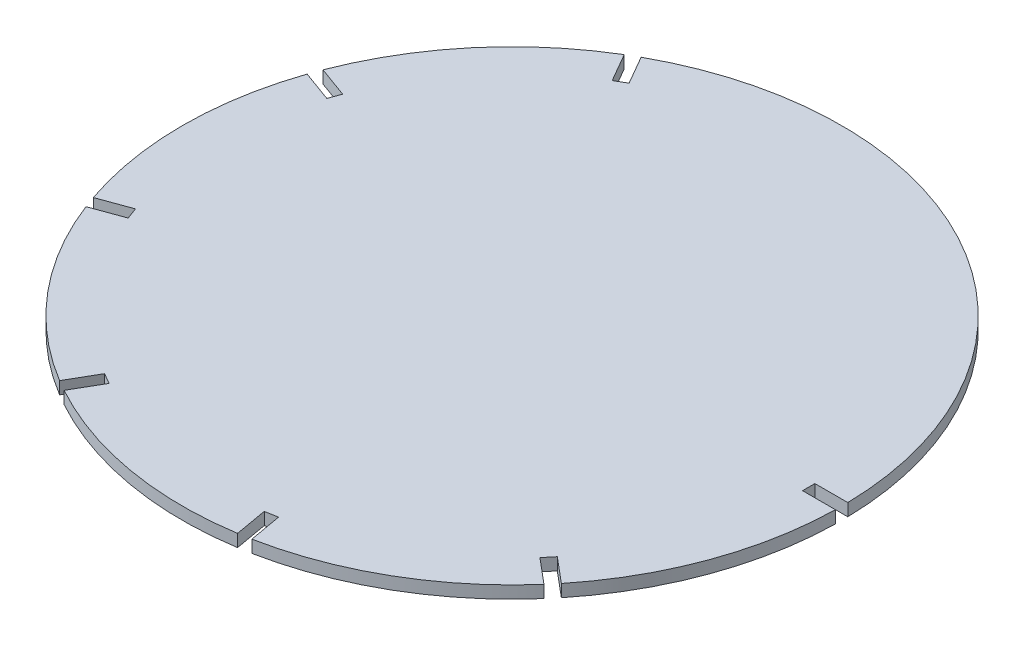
ISO-10303-21;
HEADER;
FILE_DESCRIPTION(('STEP AP214'),'2;1');
FILE_NAME('part.step','',(''),(''),'','','');
FILE_SCHEMA(('AUTOMOTIVE_DESIGN { 1 0 10303 214 1 1 1 1 }'));
ENDSEC;
DATA;
#1=APPLICATION_CONTEXT('core data for automotive mechanical design processes');
#2=APPLICATION_PROTOCOL_DEFINITION('international standard','automotive_design',2000,#1);
#3=PRODUCT_CONTEXT('',#1,'mechanical');
#4=PRODUCT('Part','Part','',(#3));
#5=PRODUCT_RELATED_PRODUCT_CATEGORY('part','',(#4));
#6=PRODUCT_DEFINITION_FORMATION('','',#4);
#7=PRODUCT_DEFINITION_CONTEXT('part definition',#1,'design');
#8=PRODUCT_DEFINITION('design','',#6,#7);
#9=PRODUCT_DEFINITION_SHAPE('','',#8);
#10=(LENGTH_UNIT() NAMED_UNIT(*) SI_UNIT(.MILLI.,.METRE.));
#11=(NAMED_UNIT(*) PLANE_ANGLE_UNIT() SI_UNIT($,.RADIAN.));
#12=(NAMED_UNIT(*) SI_UNIT($,.STERADIAN.) SOLID_ANGLE_UNIT());
#13=UNCERTAINTY_MEASURE_WITH_UNIT(LENGTH_MEASURE(1.E-05),#10,'distance_accuracy_value','');
#14=(GEOMETRIC_REPRESENTATION_CONTEXT(3) GLOBAL_UNCERTAINTY_ASSIGNED_CONTEXT((#13)) GLOBAL_UNIT_ASSIGNED_CONTEXT((#10,
#11,#12)) REPRESENTATION_CONTEXT('',''));
#15=CARTESIAN_POINT('',(0.,0.,0.));
#16=DIRECTION('',(0.,0.,1.));
#17=DIRECTION('',(1.,0.,0.));
#18=AXIS2_PLACEMENT_3D('',#15,#16,#17);
#19=CARTESIAN_POINT('',(0.,15.,0.));
#20=DIRECTION('',(0.,-1.,0.));
#21=DIRECTION('',(0.,0.,-1.));
#22=AXIS2_PLACEMENT_3D('',#19,#20,#21);
#23=CYLINDRICAL_SURFACE('',#22,400.);
#24=DIRECTION('',(0.,-1.,0.));
#25=VECTOR('',#24,1.);
#26=CARTESIAN_POINT('',(-193.46965013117,15.,350.099263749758));
#27=LINE('',#26,#25);
#28=CARTESIAN_POINT('',(-193.46965013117,0.,350.099263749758));
#29=VERTEX_POINT('',#28);
#30=CARTESIAN_POINT('',(-193.46965013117,15.,350.099263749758));
#31=VERTEX_POINT('',#30);
#32=EDGE_CURVE('E239',#29,#31,#27,.F.);
#33=ORIENTED_EDGE('',*,*,#32,.F.);
#34=CARTESIAN_POINT('',(0.,0.,0.));
#35=DIRECTION('',(0.,1.,0.));
#36=DIRECTION('',(0.,0.,1.));
#37=AXIS2_PLACEMENT_3D('',#34,#35,#36);
#38=CIRCLE('',#37,400.);
#39=CARTESIAN_POINT('',(62.0610022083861,0.,395.156212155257));
#40=VERTEX_POINT('',#39);
#41=EDGE_CURVE('E414',#29,#40,#38,.T.);
#42=ORIENTED_EDGE('',*,*,#41,.T.);
#43=DIRECTION('',(0.,-1.,0.));
#44=VECTOR('',#43,1.);
#45=CARTESIAN_POINT('',(62.0610022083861,15.,395.156212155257));
#46=LINE('',#45,#44);
#47=CARTESIAN_POINT('',(62.0610022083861,15.,395.156212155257));
#48=VERTEX_POINT('',#47);
#49=EDGE_CURVE('E368',#40,#48,#46,.F.);
#50=ORIENTED_EDGE('',*,*,#49,.T.);
#51=CARTESIAN_POINT('',(0.,15.,0.));
#52=DIRECTION('',(0.,1.,0.));
#53=DIRECTION('',(0.,0.,1.));
#54=AXIS2_PLACEMENT_3D('',#51,#52,#53);
#55=CIRCLE('',#54,400.);
#56=EDGE_CURVE('E42',#31,#48,#55,.T.);
#57=ORIENTED_EDGE('',*,*,#56,.F.);
#58=EDGE_LOOP('',(#33,#42,#50,#57));
#59=FACE_BOUND('',#58,.T.);
#60=ADVANCED_FACE('F33',(#59),#23,.T.);
#61=DIRECTION('',(0.,-1.,0.));
#62=VECTOR('',#61,1.);
#63=CARTESIAN_POINT('',(76.8331185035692,15.,392.551489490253));
#64=LINE('',#63,#62);
#65=CARTESIAN_POINT('',(76.8331185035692,0.,392.551489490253));
#66=VERTEX_POINT('',#65);
#67=CARTESIAN_POINT('',(76.8331185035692,15.,392.551489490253));
#68=VERTEX_POINT('',#67);
#69=EDGE_CURVE('E371',#66,#68,#64,.F.);
#70=ORIENTED_EDGE('',*,*,#69,.F.);
#71=CARTESIAN_POINT('',(301.543002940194,0.,262.815177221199));
#72=VERTEX_POINT('',#71);
#73=EDGE_CURVE('E419',#66,#72,#38,.T.);
#74=ORIENTED_EDGE('',*,*,#73,.T.);
#75=DIRECTION('',(0.,-1.,0.));
#76=VECTOR('',#75,1.);
#77=CARTESIAN_POINT('',(301.543002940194,15.,262.815177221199));
#78=LINE('',#77,#76);
#79=CARTESIAN_POINT('',(301.543002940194,15.,262.815177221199));
#80=VERTEX_POINT('',#79);
#81=EDGE_CURVE('E363',#72,#80,#78,.F.);
#82=ORIENTED_EDGE('',*,*,#81,.T.);
#83=EDGE_CURVE('E454',#68,#80,#55,.T.);
#84=ORIENTED_EDGE('',*,*,#83,.F.);
#85=EDGE_LOOP('',(#70,#74,#82,#84));
#86=FACE_BOUND('',#85,.T.);
#87=ADVANCED_FACE('F492',(#86),#23,.T.);
#88=DIRECTION('',(0.,-1.,0.));
#89=VECTOR('',#88,1.);
#90=CARTESIAN_POINT('',(311.184817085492,15.,251.324510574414));
#91=LINE('',#90,#89);
#92=CARTESIAN_POINT('',(311.184817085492,0.,251.324510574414));
#93=VERTEX_POINT('',#92);
#94=CARTESIAN_POINT('',(311.184817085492,15.,251.324510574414));
#95=VERTEX_POINT('',#94);
#96=EDGE_CURVE('E366',#93,#95,#91,.F.);
#97=ORIENTED_EDGE('',*,*,#96,.F.);
#98=CARTESIAN_POINT('',(399.929681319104,0.,7.5));
#99=VERTEX_POINT('',#98);
#100=EDGE_CURVE('E423',#93,#99,#38,.T.);
#101=ORIENTED_EDGE('',*,*,#100,.T.);
#102=DIRECTION('',(0.,-1.,0.));
#103=VECTOR('',#102,1.);
#104=CARTESIAN_POINT('',(399.929681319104,15.,7.5));
#105=LINE('',#104,#103);
#106=CARTESIAN_POINT('',(399.929681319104,15.,7.5));
#107=VERTEX_POINT('',#106);
#108=EDGE_CURVE('E358',#99,#107,#105,.F.);
#109=ORIENTED_EDGE('',*,*,#108,.T.);
#110=EDGE_CURVE('E452',#95,#107,#55,.T.);
#111=ORIENTED_EDGE('',*,*,#110,.F.);
#112=EDGE_LOOP('',(#97,#101,#109,#111));
#113=FACE_BOUND('',#112,.T.);
#114=ADVANCED_FACE('F505',(#113),#23,.T.);
#115=DIRECTION('',(0.,-1.,0.));
#116=VECTOR('',#115,1.);
#117=CARTESIAN_POINT('',(399.929681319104,15.,-7.5));
#118=LINE('',#117,#116);
#119=CARTESIAN_POINT('',(399.929681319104,0.,-7.5));
#120=VERTEX_POINT('',#119);
#121=CARTESIAN_POINT('',(399.929681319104,15.,-7.5));
#122=VERTEX_POINT('',#121);
#123=EDGE_CURVE('E361',#120,#122,#118,.F.);
#124=ORIENTED_EDGE('',*,*,#123,.F.);
#125=CARTESIAN_POINT('',(-193.469650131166,0.,-350.09926374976));
#126=VERTEX_POINT('',#125);
#127=EDGE_CURVE('E412',#120,#126,#38,.T.);
#128=ORIENTED_EDGE('',*,*,#127,.T.);
#129=DIRECTION('',(0.,-1.,0.));
#130=VECTOR('',#129,1.);
#131=CARTESIAN_POINT('',(-193.469650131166,15.,-350.09926374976));
#132=LINE('',#131,#130);
#133=CARTESIAN_POINT('',(-193.469650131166,15.,-350.09926374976));
#134=VERTEX_POINT('',#133);
#135=EDGE_CURVE('E58',#126,#134,#132,.F.);
#136=ORIENTED_EDGE('',*,*,#135,.T.);
#137=EDGE_CURVE('E449',#122,#134,#55,.T.);
#138=ORIENTED_EDGE('',*,*,#137,.F.);
#139=EDGE_LOOP('',(#124,#128,#136,#138));
#140=FACE_BOUND('',#139,.T.);
#141=ADVANCED_FACE('F435',(#140),#23,.T.);
#142=DIRECTION('',(0.,-1.,0.));
#143=VECTOR('',#142,1.);
#144=CARTESIAN_POINT('',(-378.376121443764,15.,-129.736312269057));
#145=LINE('',#144,#143);
#146=CARTESIAN_POINT('',(-378.376121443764,0.,-129.736312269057));
#147=VERTEX_POINT('',#146);
#148=CARTESIAN_POINT('',(-378.376121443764,15.,-129.736312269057));
#149=VERTEX_POINT('',#148);
#150=EDGE_CURVE('E356',#147,#149,#145,.F.);
#151=ORIENTED_EDGE('',*,*,#150,.F.);
#152=CARTESIAN_POINT('',(-378.376121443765,0.,129.736312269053));
#153=VERTEX_POINT('',#152);
#154=EDGE_CURVE('E402',#147,#153,#38,.T.);
#155=ORIENTED_EDGE('',*,*,#154,.T.);
#156=DIRECTION('',(0.,-1.,0.));
#157=VECTOR('',#156,1.);
#158=CARTESIAN_POINT('',(-378.376121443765,15.,129.736312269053));
#159=LINE('',#158,#157);
#160=CARTESIAN_POINT('',(-378.376121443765,15.,129.736312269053));
#161=VERTEX_POINT('',#160);
#162=EDGE_CURVE('E397',#153,#161,#159,.F.);
#163=ORIENTED_EDGE('',*,*,#162,.T.);
#164=EDGE_CURVE('E43',#149,#161,#55,.T.);
#165=ORIENTED_EDGE('',*,*,#164,.F.);
#166=EDGE_LOOP('',(#151,#155,#163,#165));
#167=FACE_BOUND('',#166,.T.);
#168=ADVANCED_FACE('F472',(#167),#23,.T.);
#169=CARTESIAN_POINT('',(-206.460031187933,0.,-342.59926374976));
#170=VERTEX_POINT('',#169);
#171=CARTESIAN_POINT('',(-373.245819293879,0.,-143.831701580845));
#172=VERTEX_POINT('',#171);
#173=EDGE_CURVE('E406',#170,#172,#38,.T.);
#174=ORIENTED_EDGE('',*,*,#173,.T.);
#175=DIRECTION('',(0.,-1.,0.));
#176=VECTOR('',#175,1.);
#177=CARTESIAN_POINT('',(-373.245819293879,15.,-143.831701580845));
#178=LINE('',#177,#176);
#179=CARTESIAN_POINT('',(-373.245819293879,15.,-143.831701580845));
#180=VERTEX_POINT('',#179);
#181=EDGE_CURVE('E50',#172,#180,#178,.F.);
#182=ORIENTED_EDGE('',*,*,#181,.T.);
#183=CARTESIAN_POINT('',(-206.460031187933,15.,-342.59926374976));
#184=VERTEX_POINT('',#183);
#185=EDGE_CURVE('E417',#184,#180,#55,.T.);
#186=ORIENTED_EDGE('',*,*,#185,.F.);
#187=DIRECTION('',(0.,-1.,0.));
#188=VECTOR('',#187,1.);
#189=CARTESIAN_POINT('',(-206.460031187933,15.,-342.59926374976));
#190=LINE('',#189,#188);
#191=EDGE_CURVE('E247',#170,#184,#190,.F.);
#192=ORIENTED_EDGE('',*,*,#191,.F.);
#193=EDGE_LOOP('',(#174,#182,#186,#192));
#194=FACE_BOUND('',#193,.T.);
#195=ADVANCED_FACE('F461',(#194),#23,.T.);
#196=CARTESIAN_POINT('',(0.,15.,0.));
#197=DIRECTION('',(0.,1.,0.));
#198=DIRECTION('',(0.,0.,1.));
#199=AXIS2_PLACEMENT_3D('',#196,#197,#198);
#200=PLANE('',#199);
#201=DIRECTION('',(-0.866025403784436,0.,-0.500000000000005));
#202=VECTOR('',#201,1.);
#203=CARTESIAN_POINT('',(-173.504809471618,15.,315.519145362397));
#204=LINE('',#203,#202);
#205=CARTESIAN_POINT('',(-173.504809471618,15.,315.519145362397));
#206=VERTEX_POINT('',#205);
#207=CARTESIAN_POINT('',(-186.495190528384,15.,308.019145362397));
#208=VERTEX_POINT('',#207);
#209=EDGE_CURVE('E226',#206,#208,#204,.T.);
#210=ORIENTED_EDGE('',*,*,#209,.F.);
#211=DIRECTION('',(-0.500000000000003,0.,0.866025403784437));
#212=VECTOR('',#211,1.);
#213=CARTESIAN_POINT('',(-173.504809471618,15.,315.519145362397));
#214=LINE('',#213,#212);
#215=EDGE_CURVE('E236',#206,#31,#214,.T.);
#216=ORIENTED_EDGE('',*,*,#215,.T.);
#217=ORIENTED_EDGE('',*,*,#56,.T.);
#218=DIRECTION('',(0.173648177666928,0.,0.984807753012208));
#219=VECTOR('',#218,1.);
#220=CARTESIAN_POINT('',(55.1272858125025,15.,355.833152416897));
#221=LINE('',#220,#219);
#222=CARTESIAN_POINT('',(55.1272858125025,15.,355.833152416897));
#223=VERTEX_POINT('',#222);
#224=EDGE_CURVE('E266',#223,#48,#221,.T.);
#225=ORIENTED_EDGE('',*,*,#224,.F.);
#226=DIRECTION('',(-0.984807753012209,0.,0.173648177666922));
#227=VECTOR('',#226,1.);
#228=CARTESIAN_POINT('',(69.8994021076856,15.,353.228429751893));
#229=LINE('',#228,#227);
#230=CARTESIAN_POINT('',(69.8994021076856,15.,353.228429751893));
#231=VERTEX_POINT('',#230);
#232=EDGE_CURVE('E233',#231,#223,#229,.T.);
#233=ORIENTED_EDGE('',*,*,#232,.F.);
#234=DIRECTION('',(0.173648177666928,0.,0.984807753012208));
#235=VECTOR('',#234,1.);
#236=CARTESIAN_POINT('',(69.8994021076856,15.,353.228429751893));
#237=LINE('',#236,#235);
#238=EDGE_CURVE('E263',#231,#68,#237,.T.);
#239=ORIENTED_EDGE('',*,*,#238,.T.);
#240=ORIENTED_EDGE('',*,*,#83,.T.);
#241=DIRECTION('',(0.766044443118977,0.,0.64278760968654));
#242=VECTOR('',#241,1.);
#243=CARTESIAN_POINT('',(270.955092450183,15.,237.148872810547));
#244=LINE('',#243,#242);
#245=CARTESIAN_POINT('',(270.955092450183,15.,237.148872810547));
#246=VERTEX_POINT('',#245);
#247=EDGE_CURVE('E286',#246,#80,#244,.T.);
#248=ORIENTED_EDGE('',*,*,#247,.F.);
#249=DIRECTION('',(-0.642787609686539,0.,0.766044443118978));
#250=VECTOR('',#249,1.);
#251=CARTESIAN_POINT('',(280.596906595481,15.,225.658206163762));
#252=LINE('',#251,#250);
#253=CARTESIAN_POINT('',(280.596906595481,15.,225.658206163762));
#254=VERTEX_POINT('',#253);
#255=EDGE_CURVE('E262',#254,#246,#252,.T.);
#256=ORIENTED_EDGE('',*,*,#255,.F.);
#257=DIRECTION('',(0.766044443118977,0.,0.64278760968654));
#258=VECTOR('',#257,1.);
#259=CARTESIAN_POINT('',(280.596906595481,15.,225.658206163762));
#260=LINE('',#259,#258);
#261=EDGE_CURVE('E283',#254,#95,#260,.T.);
#262=ORIENTED_EDGE('',*,*,#261,.T.);
#263=ORIENTED_EDGE('',*,*,#110,.T.);
#264=DIRECTION('',(1.,0.,0.));
#265=VECTOR('',#264,1.);
#266=CARTESIAN_POINT('',(360.,15.,7.5));
#267=LINE('',#266,#265);
#268=CARTESIAN_POINT('',(360.,15.,7.5));
#269=VERTEX_POINT('',#268);
#270=EDGE_CURVE('E306',#269,#107,#267,.T.);
#271=ORIENTED_EDGE('',*,*,#270,.F.);
#272=DIRECTION('',(0.,0.,1.));
#273=VECTOR('',#272,1.);
#274=CARTESIAN_POINT('',(360.,15.,-7.5));
#275=LINE('',#274,#273);
#276=CARTESIAN_POINT('',(360.,15.,-7.5));
#277=VERTEX_POINT('',#276);
#278=EDGE_CURVE('E282',#277,#269,#275,.T.);
#279=ORIENTED_EDGE('',*,*,#278,.F.);
#280=DIRECTION('',(1.,0.,0.));
#281=VECTOR('',#280,1.);
#282=CARTESIAN_POINT('',(360.,15.,-7.5));
#283=LINE('',#282,#281);
#284=EDGE_CURVE('E303',#277,#122,#283,.T.);
#285=ORIENTED_EDGE('',*,*,#284,.T.);
#286=ORIENTED_EDGE('',*,*,#137,.T.);
#287=DIRECTION('',(-0.499999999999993,0.,-0.866025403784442));
#288=VECTOR('',#287,1.);
#289=CARTESIAN_POINT('',(-173.504809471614,15.,-315.519145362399));
#290=LINE('',#289,#288);
#291=CARTESIAN_POINT('',(-173.504809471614,15.,-315.519145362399));
#292=VERTEX_POINT('',#291);
#293=EDGE_CURVE('E344',#292,#134,#290,.T.);
#294=ORIENTED_EDGE('',*,*,#293,.F.);
#295=DIRECTION('',(0.866025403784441,0.,-0.499999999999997));
#296=VECTOR('',#295,1.);
#297=CARTESIAN_POINT('',(-186.495190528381,15.,-308.019145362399));
#298=LINE('',#297,#296);
#299=CARTESIAN_POINT('',(-186.495190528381,15.,-308.019145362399));
#300=VERTEX_POINT('',#299);
#301=EDGE_CURVE('E322',#300,#292,#298,.T.);
#302=ORIENTED_EDGE('',*,*,#301,.F.);
#303=DIRECTION('',(-0.499999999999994,0.,-0.866025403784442));
#304=VECTOR('',#303,1.);
#305=CARTESIAN_POINT('',(-186.495190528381,15.,-308.019145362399));
#306=LINE('',#305,#304);
#307=EDGE_CURVE('E341',#300,#184,#306,.T.);
#308=ORIENTED_EDGE('',*,*,#307,.T.);
#309=ORIENTED_EDGE('',*,*,#185,.T.);
#310=DIRECTION('',(-0.939692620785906,0.,-0.342020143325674));
#311=VECTOR('',#310,1.);
#312=CARTESIAN_POINT('',(-335.724192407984,15.,-130.174946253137));
#313=LINE('',#312,#311);
#314=CARTESIAN_POINT('',(-335.724192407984,15.,-130.174946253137));
#315=VERTEX_POINT('',#314);
#316=EDGE_CURVE('E326',#315,#180,#313,.T.);
#317=ORIENTED_EDGE('',*,*,#316,.F.);
#318=DIRECTION('',(0.342020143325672,0.,-0.939692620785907));
#319=VECTOR('',#318,1.);
#320=CARTESIAN_POINT('',(-340.854494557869,15.,-116.079556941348));
#321=LINE('',#320,#319);
#322=CARTESIAN_POINT('',(-340.854494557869,15.,-116.079556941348));
#323=VERTEX_POINT('',#322);
#324=EDGE_CURVE('E302',#323,#315,#321,.T.);
#325=ORIENTED_EDGE('',*,*,#324,.F.);
#326=DIRECTION('',(-0.939692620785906,0.,-0.342020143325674));
#327=VECTOR('',#326,1.);
#328=CARTESIAN_POINT('',(-340.854494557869,15.,-116.079556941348));
#329=LINE('',#328,#327);
#330=EDGE_CURVE('E323',#323,#149,#329,.T.);
#331=ORIENTED_EDGE('',*,*,#330,.T.);
#332=ORIENTED_EDGE('',*,*,#164,.T.);
#333=DIRECTION('',(-0.93969262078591,0.,0.342020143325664));
#334=VECTOR('',#333,1.);
#335=CARTESIAN_POINT('',(-340.85449455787,15.,116.079556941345));
#336=LINE('',#335,#334);
#337=CARTESIAN_POINT('',(-340.85449455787,15.,116.079556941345));
#338=VERTEX_POINT('',#337);
#339=EDGE_CURVE('E390',#338,#161,#336,.T.);
#340=ORIENTED_EDGE('',*,*,#339,.F.);
#341=DIRECTION('',(-0.342020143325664,0.,-0.93969262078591));
#342=VECTOR('',#341,1.);
#343=CARTESIAN_POINT('',(-335.724192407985,15.,130.174946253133));
#344=LINE('',#343,#342);
#345=CARTESIAN_POINT('',(-335.724192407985,15.,130.174946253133));
#346=VERTEX_POINT('',#345);
#347=EDGE_CURVE('E377',#346,#338,#344,.T.);
#348=ORIENTED_EDGE('',*,*,#347,.F.);
#349=DIRECTION('',(-0.93969262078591,0.,0.342020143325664));
#350=VECTOR('',#349,1.);
#351=CARTESIAN_POINT('',(-335.724192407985,15.,130.174946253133));
#352=LINE('',#351,#350);
#353=CARTESIAN_POINT('',(-373.24581929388,15.,143.831701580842));
#354=VERTEX_POINT('',#353);
#355=EDGE_CURVE('E382',#346,#354,#352,.T.);
#356=ORIENTED_EDGE('',*,*,#355,.T.);
#357=CARTESIAN_POINT('',(-206.460031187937,15.,342.599263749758));
#358=VERTEX_POINT('',#357);
#359=EDGE_CURVE('E11',#354,#358,#55,.T.);
#360=ORIENTED_EDGE('',*,*,#359,.T.);
#361=DIRECTION('',(-0.500000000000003,0.,0.866025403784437));
#362=VECTOR('',#361,1.);
#363=CARTESIAN_POINT('',(-186.495190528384,15.,308.019145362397));
#364=LINE('',#363,#362);
#365=EDGE_CURVE('E243',#208,#358,#364,.T.);
#366=ORIENTED_EDGE('',*,*,#365,.F.);
#367=EDGE_LOOP('',(#210,#216,#217,#225,#233,#239,#240,#248,#256,#262,#263,#271,#279,#285,#286,
#294,#302,#308,#309,#317,#325,#331,#332,#340,#348,#356,#360,#366));
#368=FACE_BOUND('',#367,.T.);
#369=ADVANCED_FACE('F245',(#368),#200,.T.);
#370=CARTESIAN_POINT('',(0.,0.,0.));
#371=DIRECTION('',(0.,1.,0.));
#372=DIRECTION('',(0.,0.,1.));
#373=AXIS2_PLACEMENT_3D('',#370,#371,#372);
#374=PLANE('',#373);
#375=DIRECTION('',(-0.500000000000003,0.,0.866025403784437));
#376=VECTOR('',#375,1.);
#377=CARTESIAN_POINT('',(-173.504809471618,0.,315.519145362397));
#378=LINE('',#377,#376);
#379=CARTESIAN_POINT('',(-173.504809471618,0.,315.519145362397));
#380=VERTEX_POINT('',#379);
#381=EDGE_CURVE('E251',#380,#29,#378,.T.);
#382=ORIENTED_EDGE('',*,*,#381,.F.);
#383=DIRECTION('',(-0.866025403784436,0.,-0.500000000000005));
#384=VECTOR('',#383,1.);
#385=CARTESIAN_POINT('',(-173.504809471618,0.,315.519145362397));
#386=LINE('',#385,#384);
#387=CARTESIAN_POINT('',(-186.495190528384,0.,308.019145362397));
#388=VERTEX_POINT('',#387);
#389=EDGE_CURVE('E229',#380,#388,#386,.T.);
#390=ORIENTED_EDGE('',*,*,#389,.T.);
#391=DIRECTION('',(-0.500000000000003,0.,0.866025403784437));
#392=VECTOR('',#391,1.);
#393=CARTESIAN_POINT('',(-186.495190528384,0.,308.019145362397));
#394=LINE('',#393,#392);
#395=CARTESIAN_POINT('',(-206.460031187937,0.,342.599263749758));
#396=VERTEX_POINT('',#395);
#397=EDGE_CURVE('E253',#388,#396,#394,.T.);
#398=ORIENTED_EDGE('',*,*,#397,.T.);
#399=CARTESIAN_POINT('',(-373.24581929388,0.,143.831701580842));
#400=VERTEX_POINT('',#399);
#401=EDGE_CURVE('E37',#400,#396,#38,.T.);
#402=ORIENTED_EDGE('',*,*,#401,.F.);
#403=DIRECTION('',(-0.93969262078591,0.,0.342020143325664));
#404=VECTOR('',#403,1.);
#405=CARTESIAN_POINT('',(-335.724192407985,0.,130.174946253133));
#406=LINE('',#405,#404);
#407=CARTESIAN_POINT('',(-335.724192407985,0.,130.174946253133));
#408=VERTEX_POINT('',#407);
#409=EDGE_CURVE('E385',#408,#400,#406,.T.);
#410=ORIENTED_EDGE('',*,*,#409,.F.);
#411=DIRECTION('',(-0.342020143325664,0.,-0.93969262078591));
#412=VECTOR('',#411,1.);
#413=CARTESIAN_POINT('',(-335.724192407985,0.,130.174946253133));
#414=LINE('',#413,#412);
#415=CARTESIAN_POINT('',(-340.85449455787,0.,116.079556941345));
#416=VERTEX_POINT('',#415);
#417=EDGE_CURVE('E378',#408,#416,#414,.T.);
#418=ORIENTED_EDGE('',*,*,#417,.T.);
#419=DIRECTION('',(-0.93969262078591,0.,0.342020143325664));
#420=VECTOR('',#419,1.);
#421=CARTESIAN_POINT('',(-340.85449455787,0.,116.079556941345));
#422=LINE('',#421,#420);
#423=EDGE_CURVE('E381',#416,#153,#422,.T.);
#424=ORIENTED_EDGE('',*,*,#423,.T.);
#425=ORIENTED_EDGE('',*,*,#154,.F.);
#426=DIRECTION('',(-0.939692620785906,0.,-0.342020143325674));
#427=VECTOR('',#426,1.);
#428=CARTESIAN_POINT('',(-340.854494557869,0.,-116.079556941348));
#429=LINE('',#428,#427);
#430=CARTESIAN_POINT('',(-340.854494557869,0.,-116.079556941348));
#431=VERTEX_POINT('',#430);
#432=EDGE_CURVE('E319',#431,#147,#429,.T.);
#433=ORIENTED_EDGE('',*,*,#432,.F.);
#434=DIRECTION('',(0.342020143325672,0.,-0.939692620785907));
#435=VECTOR('',#434,1.);
#436=CARTESIAN_POINT('',(-340.854494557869,0.,-116.079556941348));
#437=LINE('',#436,#435);
#438=CARTESIAN_POINT('',(-335.724192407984,0.,-130.174946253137));
#439=VERTEX_POINT('',#438);
#440=EDGE_CURVE('E327',#431,#439,#437,.T.);
#441=ORIENTED_EDGE('',*,*,#440,.T.);
#442=DIRECTION('',(-0.939692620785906,0.,-0.342020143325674));
#443=VECTOR('',#442,1.);
#444=CARTESIAN_POINT('',(-335.724192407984,0.,-130.174946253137));
#445=LINE('',#444,#443);
#446=EDGE_CURVE('E332',#439,#172,#445,.T.);
#447=ORIENTED_EDGE('',*,*,#446,.T.);
#448=ORIENTED_EDGE('',*,*,#173,.F.);
#449=DIRECTION('',(-0.499999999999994,0.,-0.866025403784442));
#450=VECTOR('',#449,1.);
#451=CARTESIAN_POINT('',(-186.495190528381,0.,-308.019145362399));
#452=LINE('',#451,#450);
#453=CARTESIAN_POINT('',(-186.495190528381,0.,-308.019145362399));
#454=VERTEX_POINT('',#453);
#455=EDGE_CURVE('E338',#454,#170,#452,.T.);
#456=ORIENTED_EDGE('',*,*,#455,.F.);
#457=DIRECTION('',(0.866025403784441,0.,-0.499999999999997));
#458=VECTOR('',#457,1.);
#459=CARTESIAN_POINT('',(-186.495190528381,0.,-308.019145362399));
#460=LINE('',#459,#458);
#461=CARTESIAN_POINT('',(-173.504809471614,0.,-315.519145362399));
#462=VERTEX_POINT('',#461);
#463=EDGE_CURVE('E345',#454,#462,#460,.T.);
#464=ORIENTED_EDGE('',*,*,#463,.T.);
#465=DIRECTION('',(-0.499999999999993,0.,-0.866025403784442));
#466=VECTOR('',#465,1.);
#467=CARTESIAN_POINT('',(-173.504809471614,0.,-315.519145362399));
#468=LINE('',#467,#466);
#469=EDGE_CURVE('E350',#462,#126,#468,.T.);
#470=ORIENTED_EDGE('',*,*,#469,.T.);
#471=ORIENTED_EDGE('',*,*,#127,.F.);
#472=DIRECTION('',(1.,0.,0.));
#473=VECTOR('',#472,1.);
#474=CARTESIAN_POINT('',(360.,0.,-7.5));
#475=LINE('',#474,#473);
#476=CARTESIAN_POINT('',(360.,0.,-7.5));
#477=VERTEX_POINT('',#476);
#478=EDGE_CURVE('E299',#477,#120,#475,.T.);
#479=ORIENTED_EDGE('',*,*,#478,.F.);
#480=DIRECTION('',(0.,0.,1.));
#481=VECTOR('',#480,1.);
#482=CARTESIAN_POINT('',(360.,0.,-7.5));
#483=LINE('',#482,#481);
#484=CARTESIAN_POINT('',(360.,0.,7.5));
#485=VERTEX_POINT('',#484);
#486=EDGE_CURVE('E307',#477,#485,#483,.T.);
#487=ORIENTED_EDGE('',*,*,#486,.T.);
#488=DIRECTION('',(1.,0.,0.));
#489=VECTOR('',#488,1.);
#490=CARTESIAN_POINT('',(360.,0.,7.5));
#491=LINE('',#490,#489);
#492=EDGE_CURVE('E312',#485,#99,#491,.T.);
#493=ORIENTED_EDGE('',*,*,#492,.T.);
#494=ORIENTED_EDGE('',*,*,#100,.F.);
#495=DIRECTION('',(0.766044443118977,0.,0.64278760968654));
#496=VECTOR('',#495,1.);
#497=CARTESIAN_POINT('',(280.596906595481,0.,225.658206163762));
#498=LINE('',#497,#496);
#499=CARTESIAN_POINT('',(280.596906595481,0.,225.658206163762));
#500=VERTEX_POINT('',#499);
#501=EDGE_CURVE('E279',#500,#93,#498,.T.);
#502=ORIENTED_EDGE('',*,*,#501,.F.);
#503=DIRECTION('',(-0.642787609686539,0.,0.766044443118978));
#504=VECTOR('',#503,1.);
#505=CARTESIAN_POINT('',(280.596906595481,0.,225.658206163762));
#506=LINE('',#505,#504);
#507=CARTESIAN_POINT('',(270.955092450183,0.,237.148872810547));
#508=VERTEX_POINT('',#507);
#509=EDGE_CURVE('E287',#500,#508,#506,.T.);
#510=ORIENTED_EDGE('',*,*,#509,.T.);
#511=DIRECTION('',(0.766044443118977,0.,0.64278760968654));
#512=VECTOR('',#511,1.);
#513=CARTESIAN_POINT('',(270.955092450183,0.,237.148872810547));
#514=LINE('',#513,#512);
#515=EDGE_CURVE('E292',#508,#72,#514,.T.);
#516=ORIENTED_EDGE('',*,*,#515,.T.);
#517=ORIENTED_EDGE('',*,*,#73,.F.);
#518=DIRECTION('',(0.173648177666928,0.,0.984807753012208));
#519=VECTOR('',#518,1.);
#520=CARTESIAN_POINT('',(69.8994021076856,0.,353.228429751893));
#521=LINE('',#520,#519);
#522=CARTESIAN_POINT('',(69.8994021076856,0.,353.228429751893));
#523=VERTEX_POINT('',#522);
#524=EDGE_CURVE('E259',#523,#66,#521,.T.);
#525=ORIENTED_EDGE('',*,*,#524,.F.);
#526=DIRECTION('',(-0.984807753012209,0.,0.173648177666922));
#527=VECTOR('',#526,1.);
#528=CARTESIAN_POINT('',(69.8994021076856,0.,353.228429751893));
#529=LINE('',#528,#527);
#530=CARTESIAN_POINT('',(55.1272858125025,0.,355.833152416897));
#531=VERTEX_POINT('',#530);
#532=EDGE_CURVE('E267',#523,#531,#529,.T.);
#533=ORIENTED_EDGE('',*,*,#532,.T.);
#534=DIRECTION('',(0.173648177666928,0.,0.984807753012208));
#535=VECTOR('',#534,1.);
#536=CARTESIAN_POINT('',(55.1272858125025,0.,355.833152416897));
#537=LINE('',#536,#535);
#538=EDGE_CURVE('E272',#531,#40,#537,.T.);
#539=ORIENTED_EDGE('',*,*,#538,.T.);
#540=ORIENTED_EDGE('',*,*,#41,.F.);
#541=EDGE_LOOP('',(#382,#390,#398,#402,#410,#418,#424,#425,#433,#441,#447,#448,#456,#464,#470,
#471,#479,#487,#493,#494,#502,#510,#516,#517,#525,#533,#539,#540));
#542=FACE_BOUND('',#541,.T.);
#543=ADVANCED_FACE('F440',(#542),#374,.F.);
#544=ORIENTED_EDGE('',*,*,#401,.T.);
#545=DIRECTION('',(0.,-1.,0.));
#546=VECTOR('',#545,1.);
#547=CARTESIAN_POINT('',(-206.460031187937,15.,342.599263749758));
#548=LINE('',#547,#546);
#549=EDGE_CURVE('E373',#396,#358,#548,.F.);
#550=ORIENTED_EDGE('',*,*,#549,.T.);
#551=ORIENTED_EDGE('',*,*,#359,.F.);
#552=DIRECTION('',(0.,-1.,0.));
#553=VECTOR('',#552,1.);
#554=CARTESIAN_POINT('',(-373.24581929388,15.,143.831701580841));
#555=LINE('',#554,#553);
#556=EDGE_CURVE('E401',#400,#354,#555,.F.);
#557=ORIENTED_EDGE('',*,*,#556,.F.);
#558=EDGE_LOOP('',(#544,#550,#551,#557));
#559=FACE_BOUND('',#558,.T.);
#560=ADVANCED_FACE('F35',(#559),#23,.T.);
#561=CARTESIAN_POINT('',(-335.724192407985,0.,130.174946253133));
#562=DIRECTION('',(-0.342020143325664,0.,-0.93969262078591));
#563=DIRECTION('',(-0.93969262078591,0.,0.342020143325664));
#564=AXIS2_PLACEMENT_3D('',#561,#562,#563);
#565=PLANE('',#564);
#566=ORIENTED_EDGE('',*,*,#556,.T.);
#567=ORIENTED_EDGE('',*,*,#355,.F.);
#568=DIRECTION('',(0.,1.,0.));
#569=VECTOR('',#568,1.);
#570=CARTESIAN_POINT('',(-335.724192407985,0.,130.174946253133));
#571=LINE('',#570,#569);
#572=EDGE_CURVE('E395',#408,#346,#571,.T.);
#573=ORIENTED_EDGE('',*,*,#572,.F.);
#574=ORIENTED_EDGE('',*,*,#409,.T.);
#575=EDGE_LOOP('',(#566,#567,#573,#574));
#576=FACE_BOUND('',#575,.T.);
#577=ADVANCED_FACE('F527',(#576),#565,.T.);
#578=CARTESIAN_POINT('',(-340.85449455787,0.,116.079556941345));
#579=DIRECTION('',(-0.342020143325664,0.,-0.93969262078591));
#580=DIRECTION('',(-0.93969262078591,0.,0.342020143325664));
#581=AXIS2_PLACEMENT_3D('',#578,#579,#580);
#582=PLANE('',#581);
#583=ORIENTED_EDGE('',*,*,#423,.F.);
#584=DIRECTION('',(0.,1.,0.));
#585=VECTOR('',#584,1.);
#586=CARTESIAN_POINT('',(-340.85449455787,0.,116.079556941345));
#587=LINE('',#586,#585);
#588=EDGE_CURVE('E387',#416,#338,#587,.T.);
#589=ORIENTED_EDGE('',*,*,#588,.T.);
#590=ORIENTED_EDGE('',*,*,#339,.T.);
#591=ORIENTED_EDGE('',*,*,#162,.F.);
#592=EDGE_LOOP('',(#583,#589,#590,#591));
#593=FACE_BOUND('',#592,.T.);
#594=ADVANCED_FACE('F475',(#593),#582,.F.);
#595=CARTESIAN_POINT('',(-335.724192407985,0.,130.174946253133));
#596=DIRECTION('',(0.93969262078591,0.,-0.342020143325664));
#597=DIRECTION('',(-0.342020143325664,0.,-0.93969262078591));
#598=AXIS2_PLACEMENT_3D('',#595,#596,#597);
#599=PLANE('',#598);
#600=ORIENTED_EDGE('',*,*,#347,.T.);
#601=ORIENTED_EDGE('',*,*,#588,.F.);
#602=ORIENTED_EDGE('',*,*,#417,.F.);
#603=ORIENTED_EDGE('',*,*,#572,.T.);
#604=EDGE_LOOP('',(#600,#601,#602,#603));
#605=FACE_BOUND('',#604,.T.);
#606=ADVANCED_FACE('F479',(#605),#599,.F.);
#607=CARTESIAN_POINT('',(-186.495190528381,0.,-308.019145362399));
#608=DIRECTION('',(0.866025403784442,0.,-0.499999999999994));
#609=DIRECTION('',(-0.499999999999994,0.,-0.866025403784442));
#610=AXIS2_PLACEMENT_3D('',#607,#608,#609);
#611=PLANE('',#610);
#612=ORIENTED_EDGE('',*,*,#191,.T.);
#613=ORIENTED_EDGE('',*,*,#307,.F.);
#614=DIRECTION('',(0.,1.,0.));
#615=VECTOR('',#614,1.);
#616=CARTESIAN_POINT('',(-186.495190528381,0.,-308.019145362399));
#617=LINE('',#616,#615);
#618=EDGE_CURVE('E339',#454,#300,#617,.T.);
#619=ORIENTED_EDGE('',*,*,#618,.F.);
#620=ORIENTED_EDGE('',*,*,#455,.T.);
#621=EDGE_LOOP('',(#612,#613,#619,#620));
#622=FACE_BOUND('',#621,.T.);
#623=ADVANCED_FACE('F577',(#622),#611,.T.);
#624=CARTESIAN_POINT('',(-173.504809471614,0.,-315.519145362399));
#625=DIRECTION('',(0.866025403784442,0.,-0.499999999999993));
#626=DIRECTION('',(-0.499999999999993,0.,-0.866025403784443));
#627=AXIS2_PLACEMENT_3D('',#624,#625,#626);
#628=PLANE('',#627);
#629=ORIENTED_EDGE('',*,*,#469,.F.);
#630=DIRECTION('',(0.,1.,0.));
#631=VECTOR('',#630,1.);
#632=CARTESIAN_POINT('',(-173.504809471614,0.,-315.519145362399));
#633=LINE('',#632,#631);
#634=EDGE_CURVE('E336',#462,#292,#633,.T.);
#635=ORIENTED_EDGE('',*,*,#634,.T.);
#636=ORIENTED_EDGE('',*,*,#293,.T.);
#637=ORIENTED_EDGE('',*,*,#135,.F.);
#638=EDGE_LOOP('',(#629,#635,#636,#637));
#639=FACE_BOUND('',#638,.T.);
#640=ADVANCED_FACE('F443',(#639),#628,.F.);
#641=CARTESIAN_POINT('',(-186.495190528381,0.,-308.019145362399));
#642=DIRECTION('',(0.499999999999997,0.,0.866025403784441));
#643=DIRECTION('',(0.866025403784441,0.,-0.499999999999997));
#644=AXIS2_PLACEMENT_3D('',#641,#642,#643);
#645=PLANE('',#644);
#646=ORIENTED_EDGE('',*,*,#301,.T.);
#647=ORIENTED_EDGE('',*,*,#634,.F.);
#648=ORIENTED_EDGE('',*,*,#463,.F.);
#649=ORIENTED_EDGE('',*,*,#618,.T.);
#650=EDGE_LOOP('',(#646,#647,#648,#649));
#651=FACE_BOUND('',#650,.T.);
#652=ADVANCED_FACE('F447',(#651),#645,.F.);
#653=CARTESIAN_POINT('',(-340.854494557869,0.,-116.079556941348));
#654=DIRECTION('',(0.342020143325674,0.,-0.939692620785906));
#655=DIRECTION('',(-0.939692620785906,0.,-0.342020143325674));
#656=AXIS2_PLACEMENT_3D('',#653,#654,#655);
#657=PLANE('',#656);
#658=ORIENTED_EDGE('',*,*,#150,.T.);
#659=ORIENTED_EDGE('',*,*,#330,.F.);
#660=DIRECTION('',(0.,1.,0.));
#661=VECTOR('',#660,1.);
#662=CARTESIAN_POINT('',(-340.854494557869,0.,-116.079556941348));
#663=LINE('',#662,#661);
#664=EDGE_CURVE('E320',#431,#323,#663,.T.);
#665=ORIENTED_EDGE('',*,*,#664,.F.);
#666=ORIENTED_EDGE('',*,*,#432,.T.);
#667=EDGE_LOOP('',(#658,#659,#665,#666));
#668=FACE_BOUND('',#667,.T.);
#669=ADVANCED_FACE('F600',(#668),#657,.T.);
#670=CARTESIAN_POINT('',(-335.724192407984,0.,-130.174946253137));
#671=DIRECTION('',(0.342020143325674,0.,-0.939692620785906));
#672=DIRECTION('',(-0.939692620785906,0.,-0.342020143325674));
#673=AXIS2_PLACEMENT_3D('',#670,#671,#672);
#674=PLANE('',#673);
#675=ORIENTED_EDGE('',*,*,#446,.F.);
#676=DIRECTION('',(0.,1.,0.));
#677=VECTOR('',#676,1.);
#678=CARTESIAN_POINT('',(-335.724192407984,0.,-130.174946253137));
#679=LINE('',#678,#677);
#680=EDGE_CURVE('E317',#439,#315,#679,.T.);
#681=ORIENTED_EDGE('',*,*,#680,.T.);
#682=ORIENTED_EDGE('',*,*,#316,.T.);
#683=ORIENTED_EDGE('',*,*,#181,.F.);
#684=EDGE_LOOP('',(#675,#681,#682,#683));
#685=FACE_BOUND('',#684,.T.);
#686=ADVANCED_FACE('F465',(#685),#674,.F.);
#687=CARTESIAN_POINT('',(-340.854494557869,0.,-116.079556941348));
#688=DIRECTION('',(0.939692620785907,0.,0.342020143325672));
#689=DIRECTION('',(0.342020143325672,0.,-0.939692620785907));
#690=AXIS2_PLACEMENT_3D('',#687,#688,#689);
#691=PLANE('',#690);
#692=ORIENTED_EDGE('',*,*,#324,.T.);
#693=ORIENTED_EDGE('',*,*,#680,.F.);
#694=ORIENTED_EDGE('',*,*,#440,.F.);
#695=ORIENTED_EDGE('',*,*,#664,.T.);
#696=EDGE_LOOP('',(#692,#693,#694,#695));
#697=FACE_BOUND('',#696,.T.);
#698=ADVANCED_FACE('F467',(#697),#691,.F.);
#699=CARTESIAN_POINT('',(360.,0.,-7.5));
#700=DIRECTION('',(0.,0.,1.));
#701=DIRECTION('',(1.,0.,0.));
#702=AXIS2_PLACEMENT_3D('',#699,#700,#701);
#703=PLANE('',#702);
#704=ORIENTED_EDGE('',*,*,#123,.T.);
#705=ORIENTED_EDGE('',*,*,#284,.F.);
#706=DIRECTION('',(0.,1.,0.));
#707=VECTOR('',#706,1.);
#708=CARTESIAN_POINT('',(360.,0.,-7.5));
#709=LINE('',#708,#707);
#710=EDGE_CURVE('E300',#477,#277,#709,.T.);
#711=ORIENTED_EDGE('',*,*,#710,.F.);
#712=ORIENTED_EDGE('',*,*,#478,.T.);
#713=EDGE_LOOP('',(#704,#705,#711,#712));
#714=FACE_BOUND('',#713,.T.);
#715=ADVANCED_FACE('F513',(#714),#703,.T.);
#716=CARTESIAN_POINT('',(360.,0.,7.5));
#717=DIRECTION('',(0.,0.,1.));
#718=DIRECTION('',(1.,0.,0.));
#719=AXIS2_PLACEMENT_3D('',#716,#717,#718);
#720=PLANE('',#719);
#721=ORIENTED_EDGE('',*,*,#492,.F.);
#722=DIRECTION('',(0.,1.,0.));
#723=VECTOR('',#722,1.);
#724=CARTESIAN_POINT('',(360.,0.,7.5));
#725=LINE('',#724,#723);
#726=EDGE_CURVE('E297',#485,#269,#725,.T.);
#727=ORIENTED_EDGE('',*,*,#726,.T.);
#728=ORIENTED_EDGE('',*,*,#270,.T.);
#729=ORIENTED_EDGE('',*,*,#108,.F.);
#730=EDGE_LOOP('',(#721,#727,#728,#729));
#731=FACE_BOUND('',#730,.T.);
#732=ADVANCED_FACE('F508',(#731),#720,.F.);
#733=CARTESIAN_POINT('',(360.,0.,-7.5));
#734=DIRECTION('',(-1.,0.,0.));
#735=DIRECTION('',(0.,0.,1.));
#736=AXIS2_PLACEMENT_3D('',#733,#734,#735);
#737=PLANE('',#736);
#738=ORIENTED_EDGE('',*,*,#278,.T.);
#739=ORIENTED_EDGE('',*,*,#726,.F.);
#740=ORIENTED_EDGE('',*,*,#486,.F.);
#741=ORIENTED_EDGE('',*,*,#710,.T.);
#742=EDGE_LOOP('',(#738,#739,#740,#741));
#743=FACE_BOUND('',#742,.T.);
#744=ADVANCED_FACE('F511',(#743),#737,.F.);
#745=CARTESIAN_POINT('',(280.596906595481,0.,225.658206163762));
#746=DIRECTION('',(-0.64278760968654,0.,0.766044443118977));
#747=DIRECTION('',(0.766044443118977,0.,0.64278760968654));
#748=AXIS2_PLACEMENT_3D('',#745,#746,#747);
#749=PLANE('',#748);
#750=ORIENTED_EDGE('',*,*,#96,.T.);
#751=ORIENTED_EDGE('',*,*,#261,.F.);
#752=DIRECTION('',(0.,1.,0.));
#753=VECTOR('',#752,1.);
#754=CARTESIAN_POINT('',(280.596906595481,0.,225.658206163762));
#755=LINE('',#754,#753);
#756=EDGE_CURVE('E280',#500,#254,#755,.T.);
#757=ORIENTED_EDGE('',*,*,#756,.F.);
#758=ORIENTED_EDGE('',*,*,#501,.T.);
#759=EDGE_LOOP('',(#750,#751,#757,#758));
#760=FACE_BOUND('',#759,.T.);
#761=ADVANCED_FACE('F636',(#760),#749,.T.);
#762=CARTESIAN_POINT('',(270.955092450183,0.,237.148872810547));
#763=DIRECTION('',(-0.64278760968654,0.,0.766044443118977));
#764=DIRECTION('',(0.766044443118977,0.,0.64278760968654));
#765=AXIS2_PLACEMENT_3D('',#762,#763,#764);
#766=PLANE('',#765);
#767=ORIENTED_EDGE('',*,*,#515,.F.);
#768=DIRECTION('',(0.,1.,0.));
#769=VECTOR('',#768,1.);
#770=CARTESIAN_POINT('',(270.955092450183,0.,237.148872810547));
#771=LINE('',#770,#769);
#772=EDGE_CURVE('E277',#508,#246,#771,.T.);
#773=ORIENTED_EDGE('',*,*,#772,.T.);
#774=ORIENTED_EDGE('',*,*,#247,.T.);
#775=ORIENTED_EDGE('',*,*,#81,.F.);
#776=EDGE_LOOP('',(#767,#773,#774,#775));
#777=FACE_BOUND('',#776,.T.);
#778=ADVANCED_FACE('F495',(#777),#766,.F.);
#779=CARTESIAN_POINT('',(280.596906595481,0.,225.658206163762));
#780=DIRECTION('',(-0.766044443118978,0.,-0.642787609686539));
#781=DIRECTION('',(-0.642787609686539,0.,0.766044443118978));
#782=AXIS2_PLACEMENT_3D('',#779,#780,#781);
#783=PLANE('',#782);
#784=ORIENTED_EDGE('',*,*,#255,.T.);
#785=ORIENTED_EDGE('',*,*,#772,.F.);
#786=ORIENTED_EDGE('',*,*,#509,.F.);
#787=ORIENTED_EDGE('',*,*,#756,.T.);
#788=EDGE_LOOP('',(#784,#785,#786,#787));
#789=FACE_BOUND('',#788,.T.);
#790=ADVANCED_FACE('F500',(#789),#783,.F.);
#791=CARTESIAN_POINT('',(69.8994021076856,0.,353.228429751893));
#792=DIRECTION('',(-0.984807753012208,0.,0.173648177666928));
#793=DIRECTION('',(0.173648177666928,0.,0.984807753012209));
#794=AXIS2_PLACEMENT_3D('',#791,#792,#793);
#795=PLANE('',#794);
#796=ORIENTED_EDGE('',*,*,#69,.T.);
#797=ORIENTED_EDGE('',*,*,#238,.F.);
#798=DIRECTION('',(0.,1.,0.));
#799=VECTOR('',#798,1.);
#800=CARTESIAN_POINT('',(69.8994021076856,0.,353.228429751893));
#801=LINE('',#800,#799);
#802=EDGE_CURVE('E260',#523,#231,#801,.T.);
#803=ORIENTED_EDGE('',*,*,#802,.F.);
#804=ORIENTED_EDGE('',*,*,#524,.T.);
#805=EDGE_LOOP('',(#796,#797,#803,#804));
#806=FACE_BOUND('',#805,.T.);
#807=ADVANCED_FACE('F658',(#806),#795,.T.);
#808=CARTESIAN_POINT('',(55.1272858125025,0.,355.833152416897));
#809=DIRECTION('',(-0.984807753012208,0.,0.173648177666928));
#810=DIRECTION('',(0.173648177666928,0.,0.984807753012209));
#811=AXIS2_PLACEMENT_3D('',#808,#809,#810);
#812=PLANE('',#811);
#813=ORIENTED_EDGE('',*,*,#538,.F.);
#814=DIRECTION('',(0.,1.,0.));
#815=VECTOR('',#814,1.);
#816=CARTESIAN_POINT('',(55.1272858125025,0.,355.833152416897));
#817=LINE('',#816,#815);
#818=EDGE_CURVE('E257',#531,#223,#817,.T.);
#819=ORIENTED_EDGE('',*,*,#818,.T.);
#820=ORIENTED_EDGE('',*,*,#224,.T.);
#821=ORIENTED_EDGE('',*,*,#49,.F.);
#822=EDGE_LOOP('',(#813,#819,#820,#821));
#823=FACE_BOUND('',#822,.T.);
#824=ADVANCED_FACE('F666',(#823),#812,.F.);
#825=CARTESIAN_POINT('',(69.8994021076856,0.,353.228429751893));
#826=DIRECTION('',(-0.173648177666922,0.,-0.984807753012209));
#827=DIRECTION('',(-0.98480775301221,0.,0.173648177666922));
#828=AXIS2_PLACEMENT_3D('',#825,#826,#827);
#829=PLANE('',#828);
#830=ORIENTED_EDGE('',*,*,#232,.T.);
#831=ORIENTED_EDGE('',*,*,#818,.F.);
#832=ORIENTED_EDGE('',*,*,#532,.F.);
#833=ORIENTED_EDGE('',*,*,#802,.T.);
#834=EDGE_LOOP('',(#830,#831,#832,#833));
#835=FACE_BOUND('',#834,.T.);
#836=ADVANCED_FACE('F675',(#835),#829,.F.);
#837=CARTESIAN_POINT('',(-173.504809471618,0.,315.519145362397));
#838=DIRECTION('',(-0.866025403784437,0.,-0.500000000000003));
#839=DIRECTION('',(-0.500000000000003,0.,0.866025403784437));
#840=AXIS2_PLACEMENT_3D('',#837,#838,#839);
#841=PLANE('',#840);
#842=ORIENTED_EDGE('',*,*,#32,.T.);
#843=ORIENTED_EDGE('',*,*,#215,.F.);
#844=DIRECTION('',(0.,1.,0.));
#845=VECTOR('',#844,1.);
#846=CARTESIAN_POINT('',(-173.504809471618,0.,315.519145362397));
#847=LINE('',#846,#845);
#848=EDGE_CURVE('E222',#380,#206,#847,.T.);
#849=ORIENTED_EDGE('',*,*,#848,.F.);
#850=ORIENTED_EDGE('',*,*,#381,.T.);
#851=EDGE_LOOP('',(#842,#843,#849,#850));
#852=FACE_BOUND('',#851,.T.);
#853=ADVANCED_FACE('F237',(#852),#841,.T.);
#854=CARTESIAN_POINT('',(-186.495190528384,0.,308.019145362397));
#855=DIRECTION('',(-0.866025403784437,0.,-0.500000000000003));
#856=DIRECTION('',(-0.500000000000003,0.,0.866025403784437));
#857=AXIS2_PLACEMENT_3D('',#854,#855,#856);
#858=PLANE('',#857);
#859=ORIENTED_EDGE('',*,*,#397,.F.);
#860=DIRECTION('',(0.,1.,0.));
#861=VECTOR('',#860,1.);
#862=CARTESIAN_POINT('',(-186.495190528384,0.,308.019145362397));
#863=LINE('',#862,#861);
#864=EDGE_CURVE('E232',#388,#208,#863,.T.);
#865=ORIENTED_EDGE('',*,*,#864,.T.);
#866=ORIENTED_EDGE('',*,*,#365,.T.);
#867=ORIENTED_EDGE('',*,*,#549,.F.);
#868=EDGE_LOOP('',(#859,#865,#866,#867));
#869=FACE_BOUND('',#868,.T.);
#870=ADVANCED_FACE('F484',(#869),#858,.F.);
#871=CARTESIAN_POINT('',(-173.504809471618,0.,315.519145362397));
#872=DIRECTION('',(0.500000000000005,0.,-0.866025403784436));
#873=DIRECTION('',(-0.866025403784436,0.,-0.500000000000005));
#874=AXIS2_PLACEMENT_3D('',#871,#872,#873);
#875=PLANE('',#874);
#876=ORIENTED_EDGE('',*,*,#209,.T.);
#877=ORIENTED_EDGE('',*,*,#864,.F.);
#878=ORIENTED_EDGE('',*,*,#389,.F.);
#879=ORIENTED_EDGE('',*,*,#848,.T.);
#880=EDGE_LOOP('',(#876,#877,#878,#879));
#881=FACE_BOUND('',#880,.T.);
#882=ADVANCED_FACE('F224',(#881),#875,.F.);
#883=CLOSED_SHELL('',(#60,#87,#114,#141,#168,#195,#369,#543,#560,#577,#594,#606,#623,#640,#652,
#669,#686,#698,#715,#732,#744,#761,#778,#790,#807,#824,#836,#853,#870,#882));
#884=MANIFOLD_SOLID_BREP('B2',#883);
#885=ADVANCED_BREP_SHAPE_REPRESENTATION('',(#18,#884),#14);
#886=SHAPE_DEFINITION_REPRESENTATION(#9,#885);
ENDSEC;
END-ISO-10303-21;
